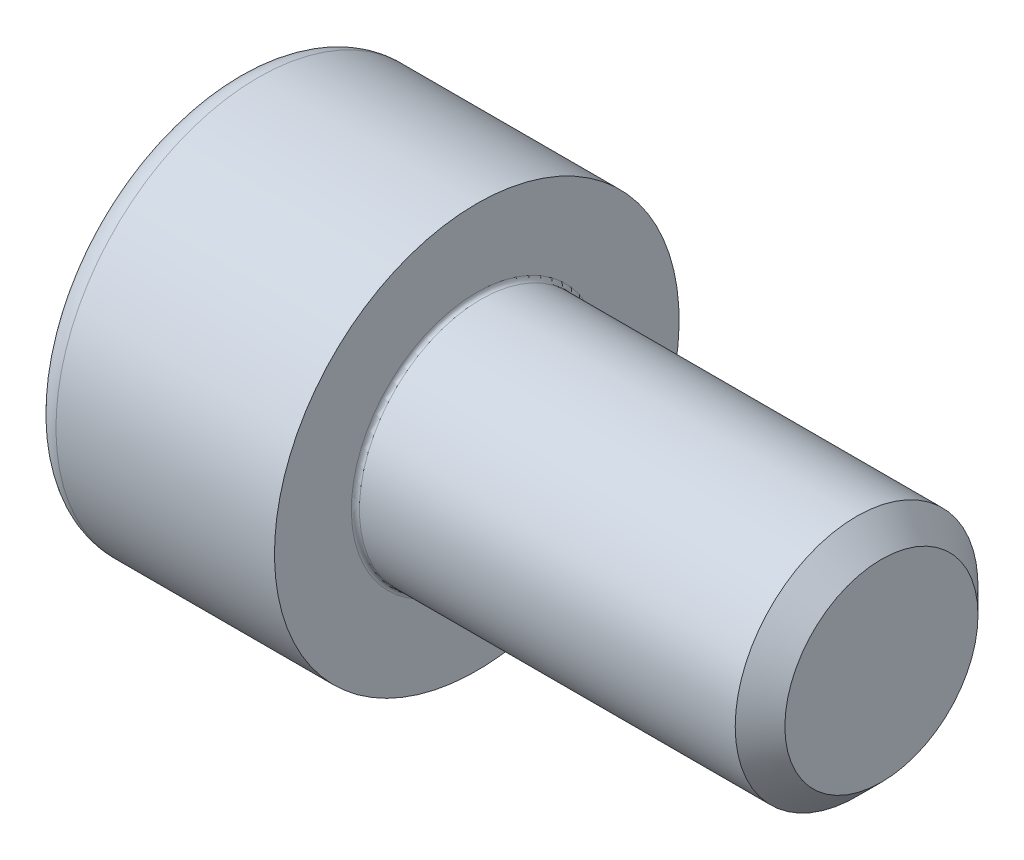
ISO-10303-21;
HEADER;
FILE_DESCRIPTION(('STEP AP214'),'2;1');
FILE_NAME('part.step','',(''),(''),'','','');
FILE_SCHEMA(('AUTOMOTIVE_DESIGN { 1 0 10303 214 1 1 1 1 }'));
ENDSEC;
DATA;
#1=APPLICATION_CONTEXT('core data for automotive mechanical design processes');
#2=APPLICATION_PROTOCOL_DEFINITION('international standard','automotive_design',2000,#1);
#3=PRODUCT_CONTEXT('',#1,'mechanical');
#4=PRODUCT('Part','Part','',(#3));
#5=PRODUCT_RELATED_PRODUCT_CATEGORY('part','',(#4));
#6=PRODUCT_DEFINITION_FORMATION('','',#4);
#7=PRODUCT_DEFINITION_CONTEXT('part definition',#1,'design');
#8=PRODUCT_DEFINITION('design','',#6,#7);
#9=PRODUCT_DEFINITION_SHAPE('','',#8);
#10=(LENGTH_UNIT() NAMED_UNIT(*) SI_UNIT(.MILLI.,.METRE.));
#11=(NAMED_UNIT(*) PLANE_ANGLE_UNIT() SI_UNIT($,.RADIAN.));
#12=(NAMED_UNIT(*) SI_UNIT($,.STERADIAN.) SOLID_ANGLE_UNIT());
#13=UNCERTAINTY_MEASURE_WITH_UNIT(LENGTH_MEASURE(1.E-05),#10,'distance_accuracy_value','');
#14=(GEOMETRIC_REPRESENTATION_CONTEXT(3) GLOBAL_UNCERTAINTY_ASSIGNED_CONTEXT((#13)) GLOBAL_UNIT_ASSIGNED_CONTEXT((#10,
#11,#12)) REPRESENTATION_CONTEXT('',''));
#15=CARTESIAN_POINT('',(0.,0.,0.));
#16=DIRECTION('',(0.,0.,1.));
#17=DIRECTION('',(1.,0.,0.));
#18=AXIS2_PLACEMENT_3D('',#15,#16,#17);
#19=CARTESIAN_POINT('',(-3.00999999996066,0.,0.));
#20=DIRECTION('',(-1.,0.,0.));
#21=DIRECTION('',(0.,0.,1.));
#22=AXIS2_PLACEMENT_3D('',#19,#20,#21);
#23=CONICAL_SURFACE('',#22,2.90407185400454,1.04719755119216);
#24=CARTESIAN_POINT('',(-1.33333333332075,5.6843418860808E-11,0.));
#25=VERTEX_POINT('',#24);
#26=VERTEX_LOOP('',#25);
#27=FACE_BOUND('',#26,.T.);
#28=CARTESIAN_POINT('',(-2.99999999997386,2.5,1.4433756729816));
#29=CARTESIAN_POINT('',(-2.96336943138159,2.5,1.31652043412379));
#30=CARTESIAN_POINT('',(-2.93005584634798,2.5,1.1885701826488));
#31=CARTESIAN_POINT('',(-2.87190798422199,2.5,0.930454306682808));
#32=CARTESIAN_POINT('',(-2.84709427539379,2.5,0.800284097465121));
#33=CARTESIAN_POINT('',(-2.80846994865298,2.5,0.541556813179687));
#34=CARTESIAN_POINT('',(-2.79440223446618,2.5,0.41303953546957));
#35=CARTESIAN_POINT('',(-2.7776114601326,2.5,0.15540057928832));
#36=CARTESIAN_POINT('',(-2.77487449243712,2.5,0.0262798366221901));
#37=CARTESIAN_POINT('',(-2.78058286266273,2.5,-0.214968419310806));
#38=CARTESIAN_POINT('',(-2.78762660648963,2.5,-0.32713213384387));
#39=CARTESIAN_POINT('',(-2.80994662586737,2.5,-0.550728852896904));
#40=CARTESIAN_POINT('',(-2.82523051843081,2.5,-0.662161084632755));
#41=CARTESIAN_POINT('',(-2.86343729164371,2.5,-0.886218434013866));
#42=CARTESIAN_POINT('',(-2.88652205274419,2.5,-0.9988152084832));
#43=CARTESIAN_POINT('',(-2.93891470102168,2.5,-1.22232986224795));
#44=CARTESIAN_POINT('',(-2.96821028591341,2.5,-1.33325060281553));
#45=CARTESIAN_POINT('',(-2.99999999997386,2.5,-1.44337567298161));
#46=B_SPLINE_CURVE_WITH_KNOTS('',3,(#28,#29,#30,#31,#32,#33,#34,#35,#36,#37,#38,#39,#40,#41,#42,
#43,#44,#45),.UNSPECIFIED.,.F.,.F.,(4,2,2,2,2,2,2,2,4),(0.,0.39627001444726,0.79349227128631,
1.18088450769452,1.56780111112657,1.90463472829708,2.24178024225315,2.58640202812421,
2.93034746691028),.UNSPECIFIED.);
#47=CARTESIAN_POINT('',(-2.99999999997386,2.50000000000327,1.44337567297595));
#48=VERTEX_POINT('',#47);
#49=CARTESIAN_POINT('',(-2.99999999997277,2.5,-1.44337567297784));
#50=VERTEX_POINT('',#49);
#51=EDGE_CURVE('E20',#48,#50,#46,.T.);
#52=ORIENTED_EDGE('',*,*,#51,.T.);
#53=CARTESIAN_POINT('',(-2.99999999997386,2.50000000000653,-1.4433756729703));
#54=CARTESIAN_POINT('',(-2.96336943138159,2.39014014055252,-1.50680329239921));
#55=CARTESIAN_POINT('',(-2.93005584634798,2.27933197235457,-1.5707784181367));
#56=CARTESIAN_POINT('',(-2.87190798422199,2.05579706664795,-1.6998363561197));
#57=CARTESIAN_POINT('',(-2.8470942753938,1.9430663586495,-1.76492146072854));
#58=CARTESIAN_POINT('',(-2.80846994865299,1.71900195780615,-1.89428510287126));
#59=CARTESIAN_POINT('',(-2.79440223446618,1.60770273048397,-1.95854374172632));
#60=CARTESIAN_POINT('',(-2.77761146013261,1.3845808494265,-2.08736321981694));
#61=CARTESIAN_POINT('',(-2.77487449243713,1.27275900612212,-2.15192359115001));
#62=CARTESIAN_POINT('',(-2.78058286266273,1.06383188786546,-2.27254771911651));
#63=CARTESIAN_POINT('',(-2.78762660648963,0.966695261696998,-2.32862957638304));
#64=CARTESIAN_POINT('',(-2.80994662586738,0.77305482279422,-2.44042793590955));
#65=CARTESIAN_POINT('',(-2.82523051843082,0.676551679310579,-2.49614405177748));
#66=CARTESIAN_POINT('',(-2.86343729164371,0.482512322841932,-2.60817272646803));
#67=CARTESIAN_POINT('',(-2.88652205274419,0.385000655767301,-2.6644711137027));
#68=CARTESIAN_POINT('',(-2.93891470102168,0.191431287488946,-2.77622844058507));
#69=CARTESIAN_POINT('',(-2.96821028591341,0.0953711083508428,-2.83168881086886));
#70=CARTESIAN_POINT('',(-2.99999999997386,-6.53091618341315E-12,-2.8867513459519));
#71=B_SPLINE_CURVE_WITH_KNOTS('',3,(#53,#54,#55,#56,#57,#58,#59,#60,#61,#62,#63,#64,#65,#66,#67,
#68,#69,#70),.UNSPECIFIED.,.F.,.F.,(4,2,2,2,2,2,2,2,4),(0.,0.39627001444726,0.793492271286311,
1.18088450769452,1.56780111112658,1.90463472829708,2.24178024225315,2.58640202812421,
2.93034746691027),.UNSPECIFIED.);
#72=CARTESIAN_POINT('',(-2.99999999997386,0.,-2.8867513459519));
#73=VERTEX_POINT('',#72);
#74=EDGE_CURVE('E80',#50,#73,#71,.T.);
#75=ORIENTED_EDGE('',*,*,#74,.T.);
#76=CARTESIAN_POINT('',(-2.99999999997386,6.53287292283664E-12,-2.8867513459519));
#77=CARTESIAN_POINT('',(-2.96336943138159,-0.10985985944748,-2.82332372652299));
#78=CARTESIAN_POINT('',(-2.93005584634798,-0.220668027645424,-2.7593486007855));
#79=CARTESIAN_POINT('',(-2.87190798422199,-0.444202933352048,-2.6302906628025));
#80=CARTESIAN_POINT('',(-2.84709427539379,-0.556933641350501,-2.56520555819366));
#81=CARTESIAN_POINT('',(-2.80846994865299,-0.780998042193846,-2.43584191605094));
#82=CARTESIAN_POINT('',(-2.79440223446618,-0.892297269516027,-2.37158327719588));
#83=CARTESIAN_POINT('',(-2.7776114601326,-1.1154191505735,-2.24276379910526));
#84=CARTESIAN_POINT('',(-2.77487449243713,-1.22724099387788,-2.17820342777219));
#85=CARTESIAN_POINT('',(-2.78058286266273,-1.43616811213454,-2.0575792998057));
#86=CARTESIAN_POINT('',(-2.78762660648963,-1.533304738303,-2.00149744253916));
#87=CARTESIAN_POINT('',(-2.80994662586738,-1.72694517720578,-1.88969908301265));
#88=CARTESIAN_POINT('',(-2.82523051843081,-1.82344832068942,-1.83398296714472));
#89=CARTESIAN_POINT('',(-2.86343729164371,-2.01748767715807,-1.72195429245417));
#90=CARTESIAN_POINT('',(-2.88652205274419,-2.1149993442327,-1.6656559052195));
#91=CARTESIAN_POINT('',(-2.93891470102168,-2.30856871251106,-1.55389857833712));
#92=CARTESIAN_POINT('',(-2.96821028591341,-2.40462889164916,-1.49843820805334));
#93=CARTESIAN_POINT('',(-2.99999999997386,-2.50000000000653,-1.44337567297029));
#94=B_SPLINE_CURVE_WITH_KNOTS('',3,(#76,#77,#78,#79,#80,#81,#82,#83,#84,#85,#86,#87,#88,#89,#90,
#91,#92,#93),.UNSPECIFIED.,.F.,.F.,(4,2,2,2,2,2,2,2,4),(0.,0.396270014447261,0.793492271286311,
1.18088450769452,1.56780111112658,1.90463472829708,2.24178024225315,2.58640202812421,
2.93034746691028),.UNSPECIFIED.);
#95=CARTESIAN_POINT('',(-2.99999999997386,-2.50000000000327,-1.44337567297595));
#96=VERTEX_POINT('',#95);
#97=EDGE_CURVE('E105',#73,#96,#94,.T.);
#98=ORIENTED_EDGE('',*,*,#97,.T.);
#99=CARTESIAN_POINT('',(-2.99999999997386,-2.5,-1.44337567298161));
#100=CARTESIAN_POINT('',(-2.96336943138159,-2.5,-1.31652043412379));
#101=CARTESIAN_POINT('',(-2.93005584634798,-2.5,-1.1885701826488));
#102=CARTESIAN_POINT('',(-2.87190798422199,-2.5,-0.93045430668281));
#103=CARTESIAN_POINT('',(-2.84709427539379,-2.5,-0.800284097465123));
#104=CARTESIAN_POINT('',(-2.80846994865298,-2.5,-0.541556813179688));
#105=CARTESIAN_POINT('',(-2.79440223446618,-2.5,-0.413039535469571));
#106=CARTESIAN_POINT('',(-2.7776114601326,-2.5,-0.155400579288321));
#107=CARTESIAN_POINT('',(-2.77487449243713,-2.5,-0.0262798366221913));
#108=CARTESIAN_POINT('',(-2.78058286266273,-2.5,0.214968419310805));
#109=CARTESIAN_POINT('',(-2.78762660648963,-2.5,0.327132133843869));
#110=CARTESIAN_POINT('',(-2.80994662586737,-2.5,0.550728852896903));
#111=CARTESIAN_POINT('',(-2.82523051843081,-2.5,0.662161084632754));
#112=CARTESIAN_POINT('',(-2.86343729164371,-2.5,0.886218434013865));
#113=CARTESIAN_POINT('',(-2.88652205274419,-2.5,0.9988152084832));
#114=CARTESIAN_POINT('',(-2.93891470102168,-2.5,1.22232986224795));
#115=CARTESIAN_POINT('',(-2.96821028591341,-2.5,1.33325060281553));
#116=CARTESIAN_POINT('',(-2.99999999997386,-2.5,1.44337567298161));
#117=B_SPLINE_CURVE_WITH_KNOTS('',3,(#99,#100,#101,#102,#103,#104,#105,#106,#107,#108,#109,#110,
#111,#112,#113,#114,#115,#116),.UNSPECIFIED.,.F.,.F.,(4,2,2,2,2,2,2,2,4),(0.,0.39627001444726,
0.79349227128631,1.18088450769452,1.56780111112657,1.90463472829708,2.24178024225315,
2.58640202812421,2.93034746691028),.UNSPECIFIED.);
#118=CARTESIAN_POINT('',(-2.99999999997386,-2.50000000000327,1.44337567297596));
#119=VERTEX_POINT('',#118);
#120=EDGE_CURVE('E129',#96,#119,#117,.T.);
#121=ORIENTED_EDGE('',*,*,#120,.T.);
#122=CARTESIAN_POINT('',(-2.99999999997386,-2.50000000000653,1.4433756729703));
#123=CARTESIAN_POINT('',(-2.96336943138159,-2.39014014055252,1.50680329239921));
#124=CARTESIAN_POINT('',(-2.93005584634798,-2.27933197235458,1.5707784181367));
#125=CARTESIAN_POINT('',(-2.87190798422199,-2.05579706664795,1.6998363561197));
#126=CARTESIAN_POINT('',(-2.8470942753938,-1.9430663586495,1.76492146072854));
#127=CARTESIAN_POINT('',(-2.80846994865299,-1.71900195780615,1.89428510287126));
#128=CARTESIAN_POINT('',(-2.79440223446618,-1.60770273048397,1.95854374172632));
#129=CARTESIAN_POINT('',(-2.77761146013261,-1.3845808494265,2.08736321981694));
#130=CARTESIAN_POINT('',(-2.77487449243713,-1.27275900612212,2.15192359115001));
#131=CARTESIAN_POINT('',(-2.78058286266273,-1.06383188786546,2.2725477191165));
#132=CARTESIAN_POINT('',(-2.78762660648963,-0.966695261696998,2.32862957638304));
#133=CARTESIAN_POINT('',(-2.80994662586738,-0.773054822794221,2.44042793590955));
#134=CARTESIAN_POINT('',(-2.82523051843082,-0.67655167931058,2.49614405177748));
#135=CARTESIAN_POINT('',(-2.86343729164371,-0.482512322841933,2.60817272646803));
#136=CARTESIAN_POINT('',(-2.88652205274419,-0.385000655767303,2.6644711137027));
#137=CARTESIAN_POINT('',(-2.93891470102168,-0.191431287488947,2.77622844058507));
#138=CARTESIAN_POINT('',(-2.96821028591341,-0.0953711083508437,2.83168881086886));
#139=CARTESIAN_POINT('',(-2.99999999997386,6.53008490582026E-12,2.8867513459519));
#140=B_SPLINE_CURVE_WITH_KNOTS('',3,(#122,#123,#124,#125,#126,#127,#128,#129,#130,#131,#132,
#133,#134,#135,#136,#137,#138,#139),.UNSPECIFIED.,.F.,.F.,(4,2,2,2,2,2,2,2,4),(0.,
0.396270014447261,0.793492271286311,1.18088450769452,1.56780111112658,1.90463472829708,
2.24178024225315,2.58640202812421,2.93034746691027),.UNSPECIFIED.);
#141=CARTESIAN_POINT('',(-2.99999999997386,0.,2.8867513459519));
#142=VERTEX_POINT('',#141);
#143=EDGE_CURVE('E137',#119,#142,#140,.T.);
#144=ORIENTED_EDGE('',*,*,#143,.T.);
#145=CARTESIAN_POINT('',(-2.99999999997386,-6.53342201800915E-12,2.8867513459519));
#146=CARTESIAN_POINT('',(-2.96336943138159,0.10985985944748,2.82332372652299));
#147=CARTESIAN_POINT('',(-2.93005584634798,0.220668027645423,2.7593486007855));
#148=CARTESIAN_POINT('',(-2.87190798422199,0.444202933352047,2.6302906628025));
#149=CARTESIAN_POINT('',(-2.84709427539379,0.5569336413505,2.56520555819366));
#150=CARTESIAN_POINT('',(-2.80846994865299,0.780998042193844,2.43584191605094));
#151=CARTESIAN_POINT('',(-2.79440223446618,0.892297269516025,2.37158327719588));
#152=CARTESIAN_POINT('',(-2.7776114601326,1.11541915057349,2.24276379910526));
#153=CARTESIAN_POINT('',(-2.77487449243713,1.22724099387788,2.17820342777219));
#154=CARTESIAN_POINT('',(-2.78058286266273,1.43616811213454,2.05757929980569));
#155=CARTESIAN_POINT('',(-2.78762660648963,1.533304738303,2.00149744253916));
#156=CARTESIAN_POINT('',(-2.80994662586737,1.72694517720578,1.88969908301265));
#157=CARTESIAN_POINT('',(-2.82523051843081,1.82344832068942,1.83398296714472));
#158=CARTESIAN_POINT('',(-2.86343729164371,2.01748767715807,1.72195429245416));
#159=CARTESIAN_POINT('',(-2.88652205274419,2.1149993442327,1.6656559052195));
#160=CARTESIAN_POINT('',(-2.93891470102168,2.30856871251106,1.55389857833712));
#161=CARTESIAN_POINT('',(-2.96821028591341,2.40462889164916,1.49843820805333));
#162=CARTESIAN_POINT('',(-2.99999999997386,2.50000000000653,1.44337567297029));
#163=B_SPLINE_CURVE_WITH_KNOTS('',3,(#145,#146,#147,#148,#149,#150,#151,#152,#153,#154,#155,
#156,#157,#158,#159,#160,#161,#162),.UNSPECIFIED.,.F.,.F.,(4,2,2,2,2,2,2,2,4),(0.,
0.396270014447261,0.793492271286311,1.18088450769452,1.56780111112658,1.90463472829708,
2.24178024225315,2.58640202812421,2.93034746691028),.UNSPECIFIED.);
#164=EDGE_CURVE('E82',#142,#48,#163,.T.);
#165=ORIENTED_EDGE('',*,*,#164,.T.);
#166=EDGE_LOOP('',(#52,#75,#98,#121,#144,#165));
#167=FACE_BOUND('',#166,.T.);
#168=ADVANCED_FACE('F16',(#27,#167),#23,.F.);
#169=CARTESIAN_POINT('',(-6.,2.5,1.44337567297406));
#170=DIRECTION('',(0.,1.,0.));
#171=DIRECTION('',(0.,0.,1.));
#172=AXIS2_PLACEMENT_3D('',#169,#170,#171);
#173=PLANE('',#172);
#174=DIRECTION('',(1.,0.,0.));
#175=VECTOR('',#174,1.);
#176=CARTESIAN_POINT('',(-6.,2.5,1.44337567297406));
#177=LINE('',#176,#175);
#178=CARTESIAN_POINT('',(-6.,2.5,1.44337567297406));
#179=VERTEX_POINT('',#178);
#180=EDGE_CURVE('E84',#48,#179,#177,.F.);
#181=ORIENTED_EDGE('',*,*,#180,.T.);
#182=DIRECTION('',(0.,0.,1.));
#183=VECTOR('',#182,1.);
#184=CARTESIAN_POINT('',(-6.,2.5,0.));
#185=LINE('',#184,#183);
#186=CARTESIAN_POINT('',(-6.,2.5,-1.44337567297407));
#187=VERTEX_POINT('',#186);
#188=EDGE_CURVE('E89',#187,#179,#185,.T.);
#189=ORIENTED_EDGE('',*,*,#188,.F.);
#190=DIRECTION('',(1.,0.,0.));
#191=VECTOR('',#190,1.);
#192=CARTESIAN_POINT('',(-6.,2.5,-1.44337567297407));
#193=LINE('',#192,#191);
#194=EDGE_CURVE('E87',#187,#50,#193,.T.);
#195=ORIENTED_EDGE('',*,*,#194,.T.);
#196=ORIENTED_EDGE('',*,*,#51,.F.);
#197=EDGE_LOOP('',(#181,#189,#195,#196));
#198=FACE_BOUND('',#197,.T.);
#199=ADVANCED_FACE('F76',(#198),#173,.F.);
#200=CARTESIAN_POINT('',(-6.,0.,2.88675134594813));
#201=DIRECTION('',(0.,0.500000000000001,0.866025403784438));
#202=DIRECTION('',(0.,-0.866025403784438,0.500000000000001));
#203=AXIS2_PLACEMENT_3D('',#200,#201,#202);
#204=PLANE('',#203);
#205=DIRECTION('',(1.,0.,0.));
#206=VECTOR('',#205,1.);
#207=CARTESIAN_POINT('',(-6.,0.,2.88675134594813));
#208=LINE('',#207,#206);
#209=CARTESIAN_POINT('',(-6.,0.,2.88675134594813));
#210=VERTEX_POINT('',#209);
#211=EDGE_CURVE('E141',#142,#210,#208,.F.);
#212=ORIENTED_EDGE('',*,*,#211,.T.);
#213=DIRECTION('',(0.,-0.866025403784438,0.500000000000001));
#214=VECTOR('',#213,1.);
#215=CARTESIAN_POINT('',(-6.,2.5,1.44337567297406));
#216=LINE('',#215,#214);
#217=EDGE_CURVE('E95',#179,#210,#216,.T.);
#218=ORIENTED_EDGE('',*,*,#217,.F.);
#219=ORIENTED_EDGE('',*,*,#180,.F.);
#220=ORIENTED_EDGE('',*,*,#164,.F.);
#221=EDGE_LOOP('',(#212,#218,#219,#220));
#222=FACE_BOUND('',#221,.T.);
#223=ADVANCED_FACE('F145',(#222),#204,.F.);
#224=CARTESIAN_POINT('',(-6.,-2.5,1.44337567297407));
#225=DIRECTION('',(0.,-0.5,0.866025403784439));
#226=DIRECTION('',(0.,-0.866025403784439,-0.5));
#227=AXIS2_PLACEMENT_3D('',#224,#225,#226);
#228=PLANE('',#227);
#229=DIRECTION('',(1.,0.,0.));
#230=VECTOR('',#229,1.);
#231=CARTESIAN_POINT('',(-6.,-2.5,1.44337567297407));
#232=LINE('',#231,#230);
#233=CARTESIAN_POINT('',(-6.,-2.5,1.44337567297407));
#234=VERTEX_POINT('',#233);
#235=EDGE_CURVE('E136',#119,#234,#232,.F.);
#236=ORIENTED_EDGE('',*,*,#235,.T.);
#237=DIRECTION('',(0.,-0.866025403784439,-0.499999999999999));
#238=VECTOR('',#237,1.);
#239=CARTESIAN_POINT('',(-6.,0.,2.88675134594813));
#240=LINE('',#239,#238);
#241=EDGE_CURVE('E264',#210,#234,#240,.T.);
#242=ORIENTED_EDGE('',*,*,#241,.F.);
#243=ORIENTED_EDGE('',*,*,#211,.F.);
#244=ORIENTED_EDGE('',*,*,#143,.F.);
#245=EDGE_LOOP('',(#236,#242,#243,#244));
#246=FACE_BOUND('',#245,.T.);
#247=ADVANCED_FACE('F125',(#246),#228,.F.);
#248=CARTESIAN_POINT('',(-6.,-2.5,-1.44337567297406));
#249=DIRECTION('',(0.,-1.,0.));
#250=DIRECTION('',(0.,0.,-1.));
#251=AXIS2_PLACEMENT_3D('',#248,#249,#250);
#252=PLANE('',#251);
#253=DIRECTION('',(1.,0.,0.));
#254=VECTOR('',#253,1.);
#255=CARTESIAN_POINT('',(-6.,-2.5,-1.44337567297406));
#256=LINE('',#255,#254);
#257=CARTESIAN_POINT('',(-6.,-2.5,-1.44337567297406));
#258=VERTEX_POINT('',#257);
#259=EDGE_CURVE('E135',#96,#258,#256,.F.);
#260=ORIENTED_EDGE('',*,*,#259,.T.);
#261=DIRECTION('',(0.,0.,1.));
#262=VECTOR('',#261,1.);
#263=CARTESIAN_POINT('',(-6.,-2.5,0.));
#264=LINE('',#263,#262);
#265=EDGE_CURVE('E259',#234,#258,#264,.F.);
#266=ORIENTED_EDGE('',*,*,#265,.F.);
#267=ORIENTED_EDGE('',*,*,#235,.F.);
#268=ORIENTED_EDGE('',*,*,#120,.F.);
#269=EDGE_LOOP('',(#260,#266,#267,#268));
#270=FACE_BOUND('',#269,.T.);
#271=ADVANCED_FACE('F121',(#270),#252,.F.);
#272=CARTESIAN_POINT('',(-6.,0.,-2.88675134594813));
#273=DIRECTION('',(0.,-0.5,-0.866025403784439));
#274=DIRECTION('',(0.,0.866025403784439,-0.5));
#275=AXIS2_PLACEMENT_3D('',#272,#273,#274);
#276=PLANE('',#275);
#277=DIRECTION('',(1.,0.,0.));
#278=VECTOR('',#277,1.);
#279=CARTESIAN_POINT('',(-6.,0.,-2.88675134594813));
#280=LINE('',#279,#278);
#281=CARTESIAN_POINT('',(-6.,0.,-2.88675134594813));
#282=VERTEX_POINT('',#281);
#283=EDGE_CURVE('E38',#73,#282,#280,.F.);
#284=ORIENTED_EDGE('',*,*,#283,.T.);
#285=DIRECTION('',(0.,0.866025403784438,-0.500000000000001));
#286=VECTOR('',#285,1.);
#287=CARTESIAN_POINT('',(-6.,-2.5,-1.44337567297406));
#288=LINE('',#287,#286);
#289=EDGE_CURVE('E254',#258,#282,#288,.T.);
#290=ORIENTED_EDGE('',*,*,#289,.F.);
#291=ORIENTED_EDGE('',*,*,#259,.F.);
#292=ORIENTED_EDGE('',*,*,#97,.F.);
#293=EDGE_LOOP('',(#284,#290,#291,#292));
#294=FACE_BOUND('',#293,.T.);
#295=ADVANCED_FACE('F115',(#294),#276,.F.);
#296=CARTESIAN_POINT('',(-6.,2.5,-1.44337567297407));
#297=DIRECTION('',(0.,0.5,-0.866025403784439));
#298=DIRECTION('',(0.,0.866025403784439,0.5));
#299=AXIS2_PLACEMENT_3D('',#296,#297,#298);
#300=PLANE('',#299);
#301=ORIENTED_EDGE('',*,*,#194,.F.);
#302=DIRECTION('',(0.,0.866025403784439,0.499999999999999));
#303=VECTOR('',#302,1.);
#304=CARTESIAN_POINT('',(-6.,0.,-2.88675134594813));
#305=LINE('',#304,#303);
#306=EDGE_CURVE('E252',#282,#187,#305,.T.);
#307=ORIENTED_EDGE('',*,*,#306,.F.);
#308=ORIENTED_EDGE('',*,*,#283,.F.);
#309=ORIENTED_EDGE('',*,*,#74,.F.);
#310=EDGE_LOOP('',(#301,#307,#308,#309));
#311=FACE_BOUND('',#310,.T.);
#312=ADVANCED_FACE('F93',(#311),#300,.F.);
#313=CARTESIAN_POINT('',(-6.,3.94337567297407,0.));
#314=DIRECTION('',(-1.,0.,0.));
#315=DIRECTION('',(0.,-1.,0.));
#316=AXIS2_PLACEMENT_3D('',#313,#314,#315);
#317=PLANE('',#316);
#318=CARTESIAN_POINT('',(-6.,0.,0.));
#319=DIRECTION('',(1.,0.,0.));
#320=DIRECTION('',(0.,1.,0.));
#321=AXIS2_PLACEMENT_3D('',#318,#319,#320);
#322=CIRCLE('',#321,4.4);
#323=CARTESIAN_POINT('',(-6.,4.4,0.));
#324=VERTEX_POINT('',#323);
#325=EDGE_CURVE('E215',#324,#324,#322,.T.);
#326=ORIENTED_EDGE('',*,*,#325,.F.);
#327=EDGE_LOOP('',(#326));
#328=FACE_BOUND('',#327,.T.);
#329=ORIENTED_EDGE('',*,*,#289,.T.);
#330=ORIENTED_EDGE('',*,*,#306,.T.);
#331=ORIENTED_EDGE('',*,*,#188,.T.);
#332=ORIENTED_EDGE('',*,*,#217,.T.);
#333=ORIENTED_EDGE('',*,*,#241,.T.);
#334=ORIENTED_EDGE('',*,*,#265,.T.);
#335=EDGE_LOOP('',(#329,#330,#331,#332,#333,#334));
#336=FACE_BOUND('',#335,.T.);
#337=ADVANCED_FACE('F114',(#328,#336),#317,.T.);
#338=CARTESIAN_POINT('',(-5.4,0.,0.));
#339=DIRECTION('',(1.,0.,0.));
#340=DIRECTION('',(0.,0.,-1.));
#341=AXIS2_PLACEMENT_3D('',#338,#339,#340);
#342=TOROIDAL_SURFACE('',#341,4.4,0.6);
#343=CARTESIAN_POINT('',(-5.4,0.,0.));
#344=DIRECTION('',(1.,0.,0.));
#345=DIRECTION('',(0.,1.,0.));
#346=AXIS2_PLACEMENT_3D('',#343,#344,#345);
#347=CIRCLE('',#346,5.);
#348=CARTESIAN_POINT('',(-5.4,5.,0.));
#349=VERTEX_POINT('',#348);
#350=EDGE_CURVE('E279',#349,#349,#347,.T.);
#351=ORIENTED_EDGE('',*,*,#350,.F.);
#352=EDGE_LOOP('',(#351));
#353=FACE_BOUND('',#352,.T.);
#354=ORIENTED_EDGE('',*,*,#325,.T.);
#355=EDGE_LOOP('',(#354));
#356=FACE_BOUND('',#355,.T.);
#357=ADVANCED_FACE('F199',(#353,#356),#342,.T.);
#358=CARTESIAN_POINT('',(-3.,0.,0.));
#359=DIRECTION('',(1.,0.,0.));
#360=DIRECTION('',(0.,1.,0.));
#361=AXIS2_PLACEMENT_3D('',#358,#359,#360);
#362=CYLINDRICAL_SURFACE('',#361,5.);
#363=ORIENTED_EDGE('',*,*,#350,.T.);
#364=EDGE_LOOP('',(#363));
#365=FACE_BOUND('',#364,.T.);
#366=CARTESIAN_POINT('',(0.,0.,0.));
#367=DIRECTION('',(1.,0.,0.));
#368=DIRECTION('',(0.,1.,0.));
#369=AXIS2_PLACEMENT_3D('',#366,#367,#368);
#370=CIRCLE('',#369,5.);
#371=CARTESIAN_POINT('',(0.,5.,0.));
#372=VERTEX_POINT('',#371);
#373=EDGE_CURVE('E103',#372,#372,#370,.T.);
#374=ORIENTED_EDGE('',*,*,#373,.F.);
#375=EDGE_LOOP('',(#374));
#376=FACE_BOUND('',#375,.T.);
#377=ADVANCED_FACE('F196',(#365,#376),#362,.T.);
#378=CARTESIAN_POINT('',(10.,1.5,0.));
#379=DIRECTION('',(1.,0.,0.));
#380=DIRECTION('',(0.,1.,0.));
#381=AXIS2_PLACEMENT_3D('',#378,#379,#380);
#382=PLANE('',#381);
#383=CARTESIAN_POINT('',(9.99999999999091,0.,0.));
#384=DIRECTION('',(-1.,0.,0.));
#385=DIRECTION('',(0.,0.,1.));
#386=AXIS2_PLACEMENT_3D('',#383,#384,#385);
#387=CIRCLE('',#386,2.38655000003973);
#388=CARTESIAN_POINT('',(9.99999999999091,0.,2.38655000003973));
#389=VERTEX_POINT('',#388);
#390=EDGE_CURVE('E274',#389,#389,#387,.T.);
#391=ORIENTED_EDGE('',*,*,#390,.F.);
#392=EDGE_LOOP('',(#391));
#393=FACE_BOUND('',#392,.T.);
#394=ADVANCED_FACE('F193',(#393),#382,.T.);
#395=CARTESIAN_POINT('',(0.,4.,0.));
#396=DIRECTION('',(1.,0.,0.));
#397=DIRECTION('',(0.,1.,0.));
#398=AXIS2_PLACEMENT_3D('',#395,#396,#397);
#399=PLANE('',#398);
#400=CARTESIAN_POINT('',(0.,0.,0.));
#401=DIRECTION('',(1.,0.,0.));
#402=DIRECTION('',(0.,1.,0.));
#403=AXIS2_PLACEMENT_3D('',#400,#401,#402);
#404=CIRCLE('',#403,3.1);
#405=CARTESIAN_POINT('',(0.,3.1,0.));
#406=VERTEX_POINT('',#405);
#407=EDGE_CURVE('E180',#406,#406,#404,.F.);
#408=ORIENTED_EDGE('',*,*,#407,.T.);
#409=EDGE_LOOP('',(#408));
#410=FACE_BOUND('',#409,.T.);
#411=ORIENTED_EDGE('',*,*,#373,.T.);
#412=EDGE_LOOP('',(#411));
#413=FACE_BOUND('',#412,.T.);
#414=ADVANCED_FACE('F184',(#410,#413),#399,.T.);
#415=CARTESIAN_POINT('',(9.38655000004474,0.,0.));
#416=DIRECTION('',(-1.,0.,0.));
#417=DIRECTION('',(0.,0.,1.));
#418=AXIS2_PLACEMENT_3D('',#415,#416,#417);
#419=CONICAL_SURFACE('',#418,3.00000000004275,0.785398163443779);
#420=ORIENTED_EDGE('',*,*,#390,.T.);
#421=EDGE_LOOP('',(#420));
#422=FACE_BOUND('',#421,.T.);
#423=CARTESIAN_POINT('',(9.38655,0.,0.));
#424=DIRECTION('',(1.,0.,0.));
#425=DIRECTION('',(0.,1.,0.));
#426=AXIS2_PLACEMENT_3D('',#423,#424,#425);
#427=CIRCLE('',#426,3.);
#428=CARTESIAN_POINT('',(9.38655,3.,0.));
#429=VERTEX_POINT('',#428);
#430=EDGE_CURVE('E29',#429,#429,#427,.F.);
#431=ORIENTED_EDGE('',*,*,#430,.F.);
#432=EDGE_LOOP('',(#431));
#433=FACE_BOUND('',#432,.T.);
#434=ADVANCED_FACE('F162',(#422,#433),#419,.T.);
#435=CARTESIAN_POINT('',(0.100000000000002,0.,0.));
#436=DIRECTION('',(1.,0.,0.));
#437=DIRECTION('',(0.,0.,-1.));
#438=AXIS2_PLACEMENT_3D('',#435,#436,#437);
#439=TOROIDAL_SURFACE('',#438,3.1,0.1);
#440=CARTESIAN_POINT('',(0.100000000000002,0.,0.));
#441=DIRECTION('',(1.,0.,0.));
#442=DIRECTION('',(0.,1.,0.));
#443=AXIS2_PLACEMENT_3D('',#440,#441,#442);
#444=CIRCLE('',#443,3.);
#445=CARTESIAN_POINT('',(0.100000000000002,3.,0.));
#446=VERTEX_POINT('',#445);
#447=EDGE_CURVE('E11',#446,#446,#444,.T.);
#448=ORIENTED_EDGE('',*,*,#447,.F.);
#449=EDGE_LOOP('',(#448));
#450=FACE_BOUND('',#449,.T.);
#451=ORIENTED_EDGE('',*,*,#407,.F.);
#452=EDGE_LOOP('',(#451));
#453=FACE_BOUND('',#452,.T.);
#454=ADVANCED_FACE('F156',(#450,#453),#439,.F.);
#455=CARTESIAN_POINT('',(6.25,0.,0.));
#456=DIRECTION('',(1.,0.,0.));
#457=DIRECTION('',(0.,1.,0.));
#458=AXIS2_PLACEMENT_3D('',#455,#456,#457);
#459=CYLINDRICAL_SURFACE('',#458,3.);
#460=ORIENTED_EDGE('',*,*,#447,.T.);
#461=EDGE_LOOP('',(#460));
#462=FACE_BOUND('',#461,.T.);
#463=ORIENTED_EDGE('',*,*,#430,.T.);
#464=EDGE_LOOP('',(#463));
#465=FACE_BOUND('',#464,.T.);
#466=ADVANCED_FACE('F154',(#462,#465),#459,.T.);
#467=CLOSED_SHELL('',(#168,#199,#223,#247,#271,#295,#312,#337,#357,#377,#394,#414,#434,#454,#466));
#468=MANIFOLD_SOLID_BREP('B1',#467);
#469=ADVANCED_BREP_SHAPE_REPRESENTATION('',(#18,#468),#14);
#470=SHAPE_DEFINITION_REPRESENTATION(#9,#469);
ENDSEC;
END-ISO-10303-21;
